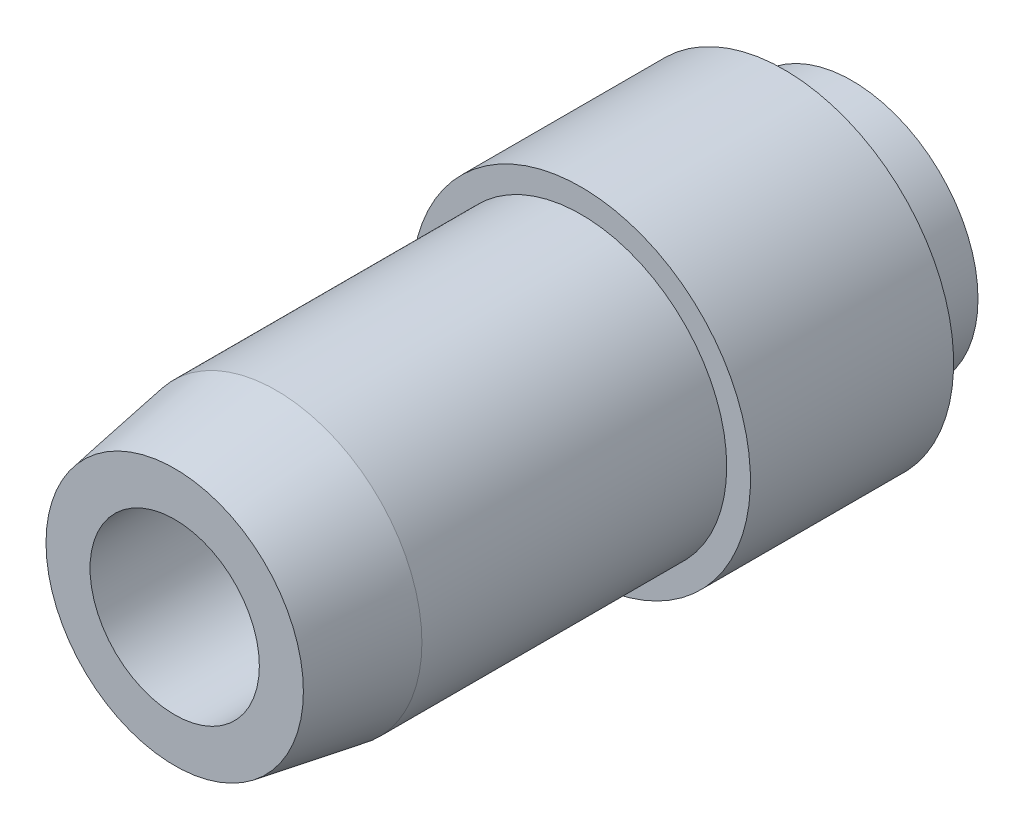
from build123d import *

# Parameters (mm, degrees)
SKETCH1_R          = 4.7244
INSET_DEPTH        = 2.54
SKETCH2_R          = 6.35
BASE_DEPTH         = 7.62
SKETCH3_R          = 5.461
NIB_DEPTH          = 15.24
SKETCH4_R          = 3.175
CUT_EXTRUDE1_DEPTH = 27.940768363
CHAMFER1_SIZE      = 3.81
CHAMFER1_SIZE2     = 0.635


with BuildPart() as part:
    # Sketch1 → inset (new body)
    with BuildSketch(Plane.XY):
        Circle(SKETCH1_R)
    extrude(amount=INSET_DEPTH)

    # Sketch2 → base (add)
    with BuildSketch(Plane.XY.offset(2.54)):
        with Locations(Location((0, 0, 0), (0, 0, 180))):
            Circle(SKETCH2_R)
    extrude(amount=BASE_DEPTH)

    # Sketch3 → nib (add)
    with BuildSketch(Plane.XY.offset(10.16)):
        with Locations(Location((0, 0, 0), (0, 0, 180))):
            Circle(SKETCH3_R)
    extrude(amount=NIB_DEPTH)

    # Sketch4 → Cut-Extrude1 (cut, through all)
    with BuildSketch(Plane.XY.offset(25.4)):
        Circle(SKETCH4_R)
    extrude(amount=-CUT_EXTRUDE1_DEPTH, mode=Mode.SUBTRACT)

    # Chamfer1
    chamfer1_edges = [part.edges().sort_by_distance(p)[0] for p in [
        (5.461, 0, 25.4),
    ]]
    chamfer1_side = [part.faces().sort_by_distance(p)[0] for p in [
        (5.461, 0, 17.78),
    ]]
    chamfer(chamfer1_edges, length=CHAMFER1_SIZE, length2=CHAMFER1_SIZE2, reference=chamfer1_side[0])


solid = part.part
